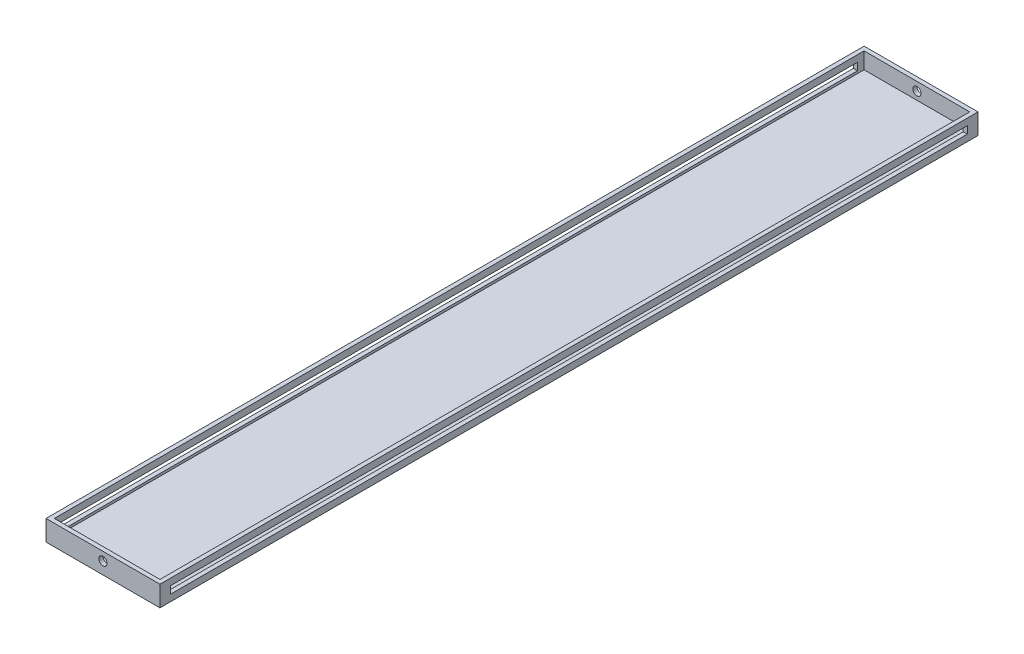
from build123d import *

# Parameters (mm, degrees)
SKETCH1_W               = 84.730952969
SKETCH1_H               = 624.731262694
BOSS_EXTRUDE1_DEPTH     = 3.175
SKETCH3_W               = 614.571262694
SKETCH3_H               = 5.665514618
BOSS_EXTRUDE2_DEPTH     = 3.175
LPATTERN1_COUNT         = 2
LPATTERN1_PITCH         = 84.709
BOSS_EXTRUDE3_DEPTH     = 3.175
BOSS_EXTRUDE4_DEPTH     = 3.175
CUT_EXTRUDE1_DEPTH      = 638.370742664
CUT_EXTRUDE1_DEPTH_BACK = 638.370742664
SKETCH6_R               = 3.175


with BuildPart() as part:
    # Sketch1 → Boss-Extrude1 (new body)
    with BuildSketch(Plane(origin=(0, 0, 0), x_dir=(1, 0, 0), z_dir=(0, 1, 0))):
        with Locations((42.365476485, 312.365631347)):
            Rectangle(SKETCH1_W, SKETCH1_H)
    extrude(amount=BOSS_EXTRUDE1_DEPTH)

    # Sketch3 → Boss-Extrude2 (add)
    with BuildSketch(Plane(origin=(84.730952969, 0, 0), x_dir=(0, 0, -1), z_dir=(1, 0, 0))):
        Polygon((0, 3.175), (0, 15.825514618), (624.731262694, 15.825514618), (624.731262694, 3.175), (624.731262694, 0), (0, 0), align=None)
        with Locations((312.365631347, 7.912757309)):
            Rectangle(SKETCH3_W, SKETCH3_H, mode=Mode.SUBTRACT)
    boss_extrude2 = extrude(amount=BOSS_EXTRUDE2_DEPTH)

    # LPattern1: Boss-Extrude2 ×2
    with Locations(*[(-i * LPATTERN1_PITCH, 0, 0) for i in range(1, LPATTERN1_COUNT)]):
        add(boss_extrude2)

    # Sketch4 → Boss-Extrude3 (add)
    with BuildSketch(Plane(origin=(0, 0, -624.731262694), x_dir=(-1, 0, 0), z_dir=(0, 0, -1))):
        Polygon((-87.905952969, 15.825514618), (-0.021952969, 15.825514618), (0, 0), (-87.905952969, 0), align=None)
    extrude(amount=BOSS_EXTRUDE3_DEPTH)

    # Sketch5 → Boss-Extrude4 (add)
    with BuildSketch(Plane.XY):
        Polygon((0.021952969, 15.825514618), (87.905952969, 15.825514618), (87.905952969, 0), (0, 0), align=None)
    extrude(amount=BOSS_EXTRUDE4_DEPTH)

    # Sketch6 → Cut-Extrude1 (cut, two sides: drawn at the far end of the back side and taken through both)
    with BuildSketch(Plane.XY.offset(3.175).offset(-CUT_EXTRUDE1_DEPTH_BACK)):
        with Locations(Location((43.963952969, 9.325929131, 0), (0, 0, 180))):
            Circle(SKETCH6_R)
    extrude(amount=CUT_EXTRUDE1_DEPTH + CUT_EXTRUDE1_DEPTH_BACK, mode=Mode.SUBTRACT)


solid = part.part
